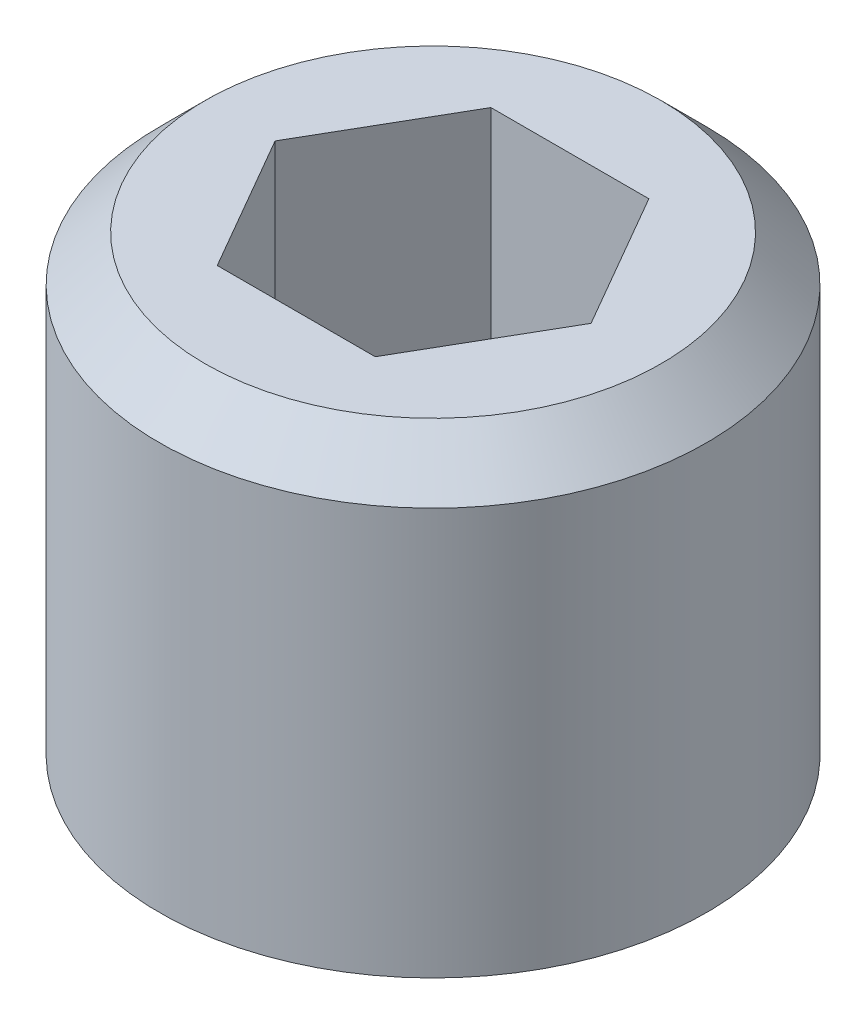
from build123d import *

# Parameters (mm, degrees)
CUT_EXTRUDE1_DEPTH = 2


with BuildPart() as part:
    # Sketch1 → Base-Revolve (revolve)
    with BuildSketch(Plane.XY, mode=Mode.PRIVATE) as base_revolve_sk:
        Polygon((0, 0.346410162), (0, 3), (1.25, 3), (1.5, 2.75), (1.5, 0.519615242), (0.6, 0), align=None)
    revolve(base_revolve_sk.sketch.rotate(Axis((0, 3, 0), (0, 1, 0)), 90), axis=Axis((0, 3, 0), (0, 1, 0)))

    # Sketch2 → Cut-Extrude1 (cut)
    with BuildSketch(Plane(origin=(0, 3, 0), x_dir=(-1, 0, 0), z_dir=(0, 1, 0))):
        Polygon((-0.433012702, 0.75), (-0.866025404, 0), (-0.433012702, -0.75), (0.433012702, -0.75), (0.866025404, 0), (0.433012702, 0.75), align=None)
    extrude(amount=-CUT_EXTRUDE1_DEPTH, mode=Mode.SUBTRACT)


solid = part.part
